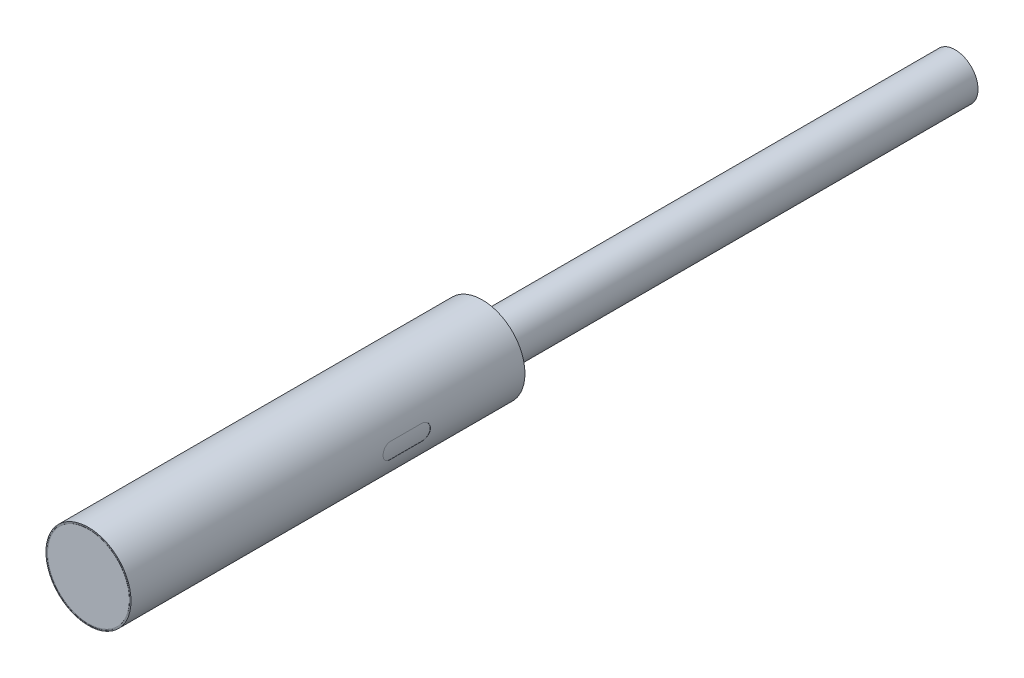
ISO-10303-21;
HEADER;
FILE_DESCRIPTION(('STEP AP214'),'2;1');
FILE_NAME('part.step','',(''),(''),'','','');
FILE_SCHEMA(('AUTOMOTIVE_DESIGN { 1 0 10303 214 1 1 1 1 }'));
ENDSEC;
DATA;
#1=APPLICATION_CONTEXT('core data for automotive mechanical design processes');
#2=APPLICATION_PROTOCOL_DEFINITION('international standard','automotive_design',2000,#1);
#3=PRODUCT_CONTEXT('',#1,'mechanical');
#4=PRODUCT('Part','Part','',(#3));
#5=PRODUCT_RELATED_PRODUCT_CATEGORY('part','',(#4));
#6=PRODUCT_DEFINITION_FORMATION('','',#4);
#7=PRODUCT_DEFINITION_CONTEXT('part definition',#1,'design');
#8=PRODUCT_DEFINITION('design','',#6,#7);
#9=PRODUCT_DEFINITION_SHAPE('','',#8);
#10=(LENGTH_UNIT() NAMED_UNIT(*) SI_UNIT(.MILLI.,.METRE.));
#11=(NAMED_UNIT(*) PLANE_ANGLE_UNIT() SI_UNIT($,.RADIAN.));
#12=(NAMED_UNIT(*) SI_UNIT($,.STERADIAN.) SOLID_ANGLE_UNIT());
#13=UNCERTAINTY_MEASURE_WITH_UNIT(LENGTH_MEASURE(1.E-05),#10,'distance_accuracy_value','');
#14=(GEOMETRIC_REPRESENTATION_CONTEXT(3) GLOBAL_UNCERTAINTY_ASSIGNED_CONTEXT((#13)) GLOBAL_UNIT_ASSIGNED_CONTEXT((#10,
#11,#12)) REPRESENTATION_CONTEXT('',''));
#15=CARTESIAN_POINT('',(0.,0.,0.));
#16=DIRECTION('',(0.,0.,1.));
#17=DIRECTION('',(1.,0.,0.));
#18=AXIS2_PLACEMENT_3D('',#15,#16,#17);
#19=CARTESIAN_POINT('',(0.,0.,-25.));
#20=DIRECTION('',(0.,0.,1.));
#21=DIRECTION('',(1.,0.,0.));
#22=AXIS2_PLACEMENT_3D('',#19,#20,#21);
#23=CYLINDRICAL_SURFACE('',#22,2.7);
#24=CARTESIAN_POINT('',(2.65383585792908,-0.497147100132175,-18.5));
#25=CARTESIAN_POINT('',(2.65397743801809,-0.496391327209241,-18.6331741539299));
#26=CARTESIAN_POINT('',(2.66464879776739,-0.445453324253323,-18.7598229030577));
#27=CARTESIAN_POINT('',(2.68300295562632,-0.306089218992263,-18.9004185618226));
#28=CARTESIAN_POINT('',(2.68888663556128,-0.252267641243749,-18.9365662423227));
#29=CARTESIAN_POINT('',(2.69755916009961,-0.130095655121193,-18.9873132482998));
#30=CARTESIAN_POINT('',(2.7,-0.0662868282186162,-18.9999999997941));
#31=CARTESIAN_POINT('',(2.7,0.0662868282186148,-18.9999999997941));
#32=CARTESIAN_POINT('',(2.69755838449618,0.130106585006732,-18.9872943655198));
#33=CARTESIAN_POINT('',(2.688887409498,0.252256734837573,-18.9365851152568));
#34=CARTESIAN_POINT('',(2.6830041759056,0.306079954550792,-18.9004091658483));
#35=CARTESIAN_POINT('',(2.67076562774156,0.399007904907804,-18.8066975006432));
#36=CARTESIAN_POINT('',(2.66488917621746,0.434748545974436,-18.7524292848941));
#37=CARTESIAN_POINT('',(2.65627069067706,0.484630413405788,-18.6302540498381));
#38=CARTESIAN_POINT('',(2.65384745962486,0.497085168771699,-18.5664734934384));
#39=CARTESIAN_POINT('',(2.65383585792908,0.497147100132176,-18.5));
#40=B_SPLINE_CURVE_WITH_KNOTS('',3,(#24,#25,#26,#27,#28,#29,#30,#31,#32,#33,#34,#35,#36,#37,#38,
#39),.UNSPECIFIED.,.F.,.F.,(4,2,2,2,2,2,2,4),(0.,0.25,0.375,0.5,0.625,0.75,0.875,1.),.UNSPECIFIED.);
#41=CARTESIAN_POINT('',(2.65383585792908,-0.497147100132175,-18.5));
#42=VERTEX_POINT('',#41);
#43=CARTESIAN_POINT('',(2.65383585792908,0.497147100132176,-18.5));
#44=VERTEX_POINT('',#43);
#45=EDGE_CURVE('E122',#42,#44,#40,.T.);
#46=ORIENTED_EDGE('',*,*,#45,.F.);
#47=DIRECTION('',(0.,0.,-1.));
#48=VECTOR('',#47,1.);
#49=CARTESIAN_POINT('',(2.65383585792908,-0.497147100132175,-16.5));
#50=LINE('',#49,#48);
#51=CARTESIAN_POINT('',(2.65383585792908,-0.497147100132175,-16.5));
#52=VERTEX_POINT('',#51);
#53=EDGE_CURVE('E128',#52,#42,#50,.T.);
#54=ORIENTED_EDGE('',*,*,#53,.F.);
#55=CARTESIAN_POINT('',(2.65383585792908,0.497147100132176,-16.5));
#56=CARTESIAN_POINT('',(2.65397743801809,0.496391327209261,-16.3668258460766));
#57=CARTESIAN_POINT('',(2.66464879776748,0.445453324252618,-16.2401770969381));
#58=CARTESIAN_POINT('',(2.68300295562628,0.306089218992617,-16.0995814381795));
#59=CARTESIAN_POINT('',(2.68888663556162,0.252267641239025,-16.0634337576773));
#60=CARTESIAN_POINT('',(2.69755916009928,0.130095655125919,-16.0126867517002));
#61=CARTESIAN_POINT('',(2.7,0.0662868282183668,-16.0000000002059));
#62=CARTESIAN_POINT('',(2.7,-0.0662868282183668,-16.0000000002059));
#63=CARTESIAN_POINT('',(2.69755838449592,-0.130106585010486,-16.0127056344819));
#64=CARTESIAN_POINT('',(2.68888740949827,-0.25225673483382,-16.0634148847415));
#65=CARTESIAN_POINT('',(2.68300417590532,-0.306079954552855,-16.0995908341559));
#66=CARTESIAN_POINT('',(2.67076562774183,-0.399007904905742,-16.1933024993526));
#67=CARTESIAN_POINT('',(2.66488917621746,-0.434748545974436,-16.2475707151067));
#68=CARTESIAN_POINT('',(2.65627069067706,-0.484630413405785,-16.369745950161));
#69=CARTESIAN_POINT('',(2.65384745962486,-0.497085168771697,-16.4335265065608));
#70=CARTESIAN_POINT('',(2.65383585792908,-0.497147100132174,-16.5));
#71=B_SPLINE_CURVE_WITH_KNOTS('',3,(#55,#56,#57,#58,#59,#60,#61,#62,#63,#64,#65,#66,#67,#68,#69,
#70),.UNSPECIFIED.,.F.,.F.,(4,2,2,2,2,2,2,4),(0.,0.25,0.375,0.5,0.625,0.75,0.875,1.),.UNSPECIFIED.);
#72=CARTESIAN_POINT('',(2.65383585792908,0.497147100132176,-16.5));
#73=VERTEX_POINT('',#72);
#74=EDGE_CURVE('E76',#73,#52,#71,.T.);
#75=ORIENTED_EDGE('',*,*,#74,.F.);
#76=DIRECTION('',(0.,0.,1.));
#77=VECTOR('',#76,1.);
#78=CARTESIAN_POINT('',(2.65383585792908,0.497147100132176,-18.5));
#79=LINE('',#78,#77);
#80=EDGE_CURVE('E113',#44,#73,#79,.T.);
#81=ORIENTED_EDGE('',*,*,#80,.F.);
#82=EDGE_LOOP('',(#46,#54,#75,#81));
#83=FACE_BOUND('',#82,.T.);
#84=CARTESIAN_POINT('',(0.,0.,-25.));
#85=DIRECTION('',(0.,0.,1.));
#86=DIRECTION('',(1.,0.,0.));
#87=AXIS2_PLACEMENT_3D('',#84,#85,#86);
#88=CIRCLE('',#87,2.7);
#89=CARTESIAN_POINT('',(2.7,0.,-25.));
#90=VERTEX_POINT('',#89);
#91=EDGE_CURVE('E68',#90,#90,#88,.T.);
#92=ORIENTED_EDGE('',*,*,#91,.T.);
#93=EDGE_LOOP('',(#92));
#94=FACE_BOUND('',#93,.T.);
#95=CARTESIAN_POINT('',(0.,0.,0.));
#96=DIRECTION('',(0.,0.,1.));
#97=DIRECTION('',(1.,0.,0.));
#98=AXIS2_PLACEMENT_3D('',#95,#96,#97);
#99=CIRCLE('',#98,2.7);
#100=CARTESIAN_POINT('',(2.7,0.,0.));
#101=VERTEX_POINT('',#100);
#102=EDGE_CURVE('E337',#101,#101,#99,.T.);
#103=ORIENTED_EDGE('',*,*,#102,.F.);
#104=EDGE_LOOP('',(#103));
#105=FACE_BOUND('',#104,.T.);
#106=ADVANCED_FACE('F58',(#83,#94,#105),#23,.T.);
#107=CARTESIAN_POINT('',(0.,0.,-25.));
#108=DIRECTION('',(0.,0.,1.));
#109=DIRECTION('',(1.,0.,0.));
#110=AXIS2_PLACEMENT_3D('',#107,#108,#109);
#111=PLANE('',#110);
#112=CARTESIAN_POINT('',(0.,0.,-25.));
#113=DIRECTION('',(0.,0.,1.));
#114=DIRECTION('',(1.,0.,0.));
#115=AXIS2_PLACEMENT_3D('',#112,#113,#114);
#116=CIRCLE('',#115,1.45);
#117=CARTESIAN_POINT('',(1.45,0.,-25.));
#118=VERTEX_POINT('',#117);
#119=EDGE_CURVE('E13',#118,#118,#116,.F.);
#120=ORIENTED_EDGE('',*,*,#119,.F.);
#121=EDGE_LOOP('',(#120));
#122=FACE_BOUND('',#121,.T.);
#123=ORIENTED_EDGE('',*,*,#91,.F.);
#124=EDGE_LOOP('',(#123));
#125=FACE_BOUND('',#124,.T.);
#126=ADVANCED_FACE('F286',(#122,#125),#111,.F.);
#127=CARTESIAN_POINT('',(0.,0.,0.));
#128=DIRECTION('',(0.,0.,1.));
#129=DIRECTION('',(1.,0.,0.));
#130=AXIS2_PLACEMENT_3D('',#127,#128,#129);
#131=PLANE('',#130);
#132=CARTESIAN_POINT('',(0.,0.,0.));
#133=DIRECTION('',(0.,0.,1.));
#134=DIRECTION('',(1.,0.,0.));
#135=AXIS2_PLACEMENT_3D('',#132,#133,#134);
#136=CIRCLE('',#135,2.65);
#137=CARTESIAN_POINT('',(2.65,0.,0.));
#138=VERTEX_POINT('',#137);
#139=EDGE_CURVE('E332',#138,#138,#136,.T.);
#140=ORIENTED_EDGE('',*,*,#139,.F.);
#141=EDGE_LOOP('',(#140));
#142=FACE_BOUND('',#141,.T.);
#143=ORIENTED_EDGE('',*,*,#102,.T.);
#144=EDGE_LOOP('',(#143));
#145=FACE_BOUND('',#144,.T.);
#146=ADVANCED_FACE('F290',(#142,#145),#131,.T.);
#147=CARTESIAN_POINT('',(0.,0.,-0.01));
#148=DIRECTION('',(0.,0.,1.));
#149=DIRECTION('',(1.,0.,0.));
#150=AXIS2_PLACEMENT_3D('',#147,#148,#149);
#151=CYLINDRICAL_SURFACE('',#150,2.65);
#152=CARTESIAN_POINT('',(0.,0.,-0.01));
#153=DIRECTION('',(0.,0.,1.));
#154=DIRECTION('',(1.,0.,0.));
#155=AXIS2_PLACEMENT_3D('',#152,#153,#154);
#156=CIRCLE('',#155,2.65);
#157=CARTESIAN_POINT('',(2.65,0.,-0.01));
#158=VERTEX_POINT('',#157);
#159=EDGE_CURVE('E334',#158,#158,#156,.T.);
#160=CARTESIAN_POINT('',(2.65,0.,-0.01));
#161=CARTESIAN_POINT('',(2.65,0.,-0.00989583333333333));
#162=CARTESIAN_POINT('',(2.65,0.,-0.00979166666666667));
#163=CARTESIAN_POINT('',(2.65,0.,-0.00958333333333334));
#164=CARTESIAN_POINT('',(2.65,0.,-0.00947916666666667));
#165=CARTESIAN_POINT('',(2.65,0.,-0.00927083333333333));
#166=CARTESIAN_POINT('',(2.65,0.,-0.00916666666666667));
#167=CARTESIAN_POINT('',(2.65,0.,-0.00895833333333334));
#168=CARTESIAN_POINT('',(2.65,0.,-0.00885416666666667));
#169=CARTESIAN_POINT('',(2.65,0.,-0.00864583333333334));
#170=CARTESIAN_POINT('',(2.65,0.,-0.00854166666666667));
#171=CARTESIAN_POINT('',(2.65,0.,-0.00833333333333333));
#172=CARTESIAN_POINT('',(2.65,0.,-0.00822916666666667));
#173=CARTESIAN_POINT('',(2.65,0.,-0.00802083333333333));
#174=CARTESIAN_POINT('',(2.65,0.,-0.00791666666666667));
#175=CARTESIAN_POINT('',(2.65,0.,-0.00770833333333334));
#176=CARTESIAN_POINT('',(2.65,0.,-0.00760416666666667));
#177=CARTESIAN_POINT('',(2.65,0.,-0.00739583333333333));
#178=CARTESIAN_POINT('',(2.65,0.,-0.00729166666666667));
#179=CARTESIAN_POINT('',(2.65,0.,-0.00708333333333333));
#180=CARTESIAN_POINT('',(2.65,0.,-0.00697916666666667));
#181=CARTESIAN_POINT('',(2.65,0.,-0.00677083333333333));
#182=CARTESIAN_POINT('',(2.65,0.,-0.00666666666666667));
#183=CARTESIAN_POINT('',(2.65,0.,-0.00645833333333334));
#184=CARTESIAN_POINT('',(2.65,0.,-0.00635416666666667));
#185=CARTESIAN_POINT('',(2.65,0.,-0.00614583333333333));
#186=CARTESIAN_POINT('',(2.65,0.,-0.00604166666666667));
#187=CARTESIAN_POINT('',(2.65,0.,-0.00583333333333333));
#188=CARTESIAN_POINT('',(2.65,0.,-0.00572916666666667));
#189=CARTESIAN_POINT('',(2.65,0.,-0.00552083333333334));
#190=CARTESIAN_POINT('',(2.65,0.,-0.00541666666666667));
#191=CARTESIAN_POINT('',(2.65,0.,-0.00520833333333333));
#192=CARTESIAN_POINT('',(2.65,0.,-0.00510416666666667));
#193=CARTESIAN_POINT('',(2.65,0.,-0.00489583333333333));
#194=CARTESIAN_POINT('',(2.65,0.,-0.00479166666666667));
#195=CARTESIAN_POINT('',(2.65,0.,-0.00458333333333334));
#196=CARTESIAN_POINT('',(2.65,0.,-0.00447916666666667));
#197=CARTESIAN_POINT('',(2.65,0.,-0.00427083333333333));
#198=CARTESIAN_POINT('',(2.65,0.,-0.00416666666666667));
#199=CARTESIAN_POINT('',(2.65,0.,-0.00395833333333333));
#200=CARTESIAN_POINT('',(2.65,0.,-0.00385416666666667));
#201=CARTESIAN_POINT('',(2.65,0.,-0.00364583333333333));
#202=CARTESIAN_POINT('',(2.65,0.,-0.00354166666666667));
#203=CARTESIAN_POINT('',(2.65,0.,-0.00333333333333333));
#204=CARTESIAN_POINT('',(2.65,0.,-0.00322916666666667));
#205=CARTESIAN_POINT('',(2.65,0.,-0.00302083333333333));
#206=CARTESIAN_POINT('',(2.65,0.,-0.00291666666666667));
#207=CARTESIAN_POINT('',(2.65,0.,-0.00270833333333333));
#208=CARTESIAN_POINT('',(2.65,0.,-0.00260416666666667));
#209=CARTESIAN_POINT('',(2.65,0.,-0.00239583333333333));
#210=CARTESIAN_POINT('',(2.65,0.,-0.00229166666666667));
#211=CARTESIAN_POINT('',(2.65,0.,-0.00208333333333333));
#212=CARTESIAN_POINT('',(2.65,0.,-0.00197916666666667));
#213=CARTESIAN_POINT('',(2.65,0.,-0.00177083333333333));
#214=CARTESIAN_POINT('',(2.65,0.,-0.00166666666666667));
#215=CARTESIAN_POINT('',(2.65,0.,-0.00145833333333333));
#216=CARTESIAN_POINT('',(2.65,0.,-0.00135416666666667));
#217=CARTESIAN_POINT('',(2.65,0.,-0.00114583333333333));
#218=CARTESIAN_POINT('',(2.65,0.,-0.00104166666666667));
#219=CARTESIAN_POINT('',(2.65,0.,-0.000833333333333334));
#220=CARTESIAN_POINT('',(2.65,0.,-0.000729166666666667));
#221=CARTESIAN_POINT('',(2.65,0.,-0.000520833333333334));
#222=CARTESIAN_POINT('',(2.65,0.,-0.000416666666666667));
#223=CARTESIAN_POINT('',(2.65,0.,-0.000208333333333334));
#224=CARTESIAN_POINT('',(2.65,0.,-0.000104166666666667));
#225=CARTESIAN_POINT('',(2.65,0.,0.));
#226=B_SPLINE_CURVE_WITH_KNOTS('',3,(#160,#161,#162,#163,#164,#165,#166,#167,#168,#169,#170,
#171,#172,#173,#174,#175,#176,#177,#178,#179,#180,#181,#182,#183,#184,#185,#186,#187,#188,#189,
#190,#191,#192,#193,#194,#195,#196,#197,#198,#199,#200,#201,#202,#203,#204,#205,#206,#207,#208,
#209,#210,#211,#212,#213,#214,#215,#216,#217,#218,#219,#220,#221,#222,#223,#224,#225),
.UNSPECIFIED.,.F.,.F.,(4,2,2,2,2,2,2,2,2,2,2,2,2,2,2,2,2,2,2,2,2,2,2,2,2,2,2,2,2,2,2,2,4),(0.,
0.000312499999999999,0.000625,0.000937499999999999,0.00125,0.0015625,0.001875,0.0021875,0.0025,
0.0028125,0.003125,0.0034375,0.00375,0.0040625,0.004375,0.0046875,0.005,0.0053125,0.005625,
0.0059375,0.00625,0.0065625,0.006875,0.0071875,0.0075,0.0078125,0.008125,0.0084375,0.00875,
0.0090625,0.009375,0.0096875,0.01),.UNSPECIFIED.);
#227=EDGE_CURVE('BSEAM296',#158,#138,#226,.T.);
#228=ORIENTED_EDGE('',*,*,#159,.F.);
#229=ORIENTED_EDGE('',*,*,#139,.T.);
#230=ORIENTED_EDGE('',*,*,#227,.T.);
#231=ORIENTED_EDGE('',*,*,#227,.F.);
#232=EDGE_LOOP('',(#228,#230,#229,#231));
#233=FACE_BOUND('',#232,.T.);
#234=ADVANCED_FACE('F296',(#233),#151,.F.);
#235=CARTESIAN_POINT('',(0.,0.,-0.01));
#236=DIRECTION('',(0.,0.,1.));
#237=DIRECTION('',(1.,0.,0.));
#238=AXIS2_PLACEMENT_3D('',#235,#236,#237);
#239=PLANE('',#238);
#240=CARTESIAN_POINT('',(0.,0.,-0.01));
#241=DIRECTION('',(0.,0.,1.));
#242=DIRECTION('',(1.,0.,0.));
#243=AXIS2_PLACEMENT_3D('',#240,#241,#242);
#244=CIRCLE('',#243,2.6);
#245=CARTESIAN_POINT('',(2.6,0.,-0.01));
#246=VERTEX_POINT('',#245);
#247=EDGE_CURVE('E325',#246,#246,#244,.T.);
#248=ORIENTED_EDGE('',*,*,#247,.F.);
#249=EDGE_LOOP('',(#248));
#250=FACE_BOUND('',#249,.T.);
#251=ORIENTED_EDGE('',*,*,#159,.T.);
#252=EDGE_LOOP('',(#251));
#253=FACE_BOUND('',#252,.T.);
#254=ADVANCED_FACE('F304',(#250,#253),#239,.T.);
#255=CARTESIAN_POINT('',(0.,0.,-0.01));
#256=DIRECTION('',(0.,0.,1.));
#257=DIRECTION('',(1.,0.,0.));
#258=AXIS2_PLACEMENT_3D('',#255,#256,#257);
#259=CYLINDRICAL_SURFACE('',#258,2.6);
#260=CARTESIAN_POINT('',(0.,0.,0.));
#261=DIRECTION('',(0.,0.,1.));
#262=DIRECTION('',(1.,0.,0.));
#263=AXIS2_PLACEMENT_3D('',#260,#261,#262);
#264=CIRCLE('',#263,2.6);
#265=CARTESIAN_POINT('',(2.6,0.,0.));
#266=VERTEX_POINT('',#265);
#267=EDGE_CURVE('E322',#266,#266,#264,.T.);
#268=CARTESIAN_POINT('',(2.6,0.,-0.01));
#269=CARTESIAN_POINT('',(2.6,0.,-0.00989583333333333));
#270=CARTESIAN_POINT('',(2.6,0.,-0.00979166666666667));
#271=CARTESIAN_POINT('',(2.6,0.,-0.00958333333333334));
#272=CARTESIAN_POINT('',(2.6,0.,-0.00947916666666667));
#273=CARTESIAN_POINT('',(2.6,0.,-0.00927083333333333));
#274=CARTESIAN_POINT('',(2.6,0.,-0.00916666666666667));
#275=CARTESIAN_POINT('',(2.6,0.,-0.00895833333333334));
#276=CARTESIAN_POINT('',(2.6,0.,-0.00885416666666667));
#277=CARTESIAN_POINT('',(2.6,0.,-0.00864583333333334));
#278=CARTESIAN_POINT('',(2.6,0.,-0.00854166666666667));
#279=CARTESIAN_POINT('',(2.6,0.,-0.00833333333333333));
#280=CARTESIAN_POINT('',(2.6,0.,-0.00822916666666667));
#281=CARTESIAN_POINT('',(2.6,0.,-0.00802083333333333));
#282=CARTESIAN_POINT('',(2.6,0.,-0.00791666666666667));
#283=CARTESIAN_POINT('',(2.6,0.,-0.00770833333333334));
#284=CARTESIAN_POINT('',(2.6,0.,-0.00760416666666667));
#285=CARTESIAN_POINT('',(2.6,0.,-0.00739583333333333));
#286=CARTESIAN_POINT('',(2.6,0.,-0.00729166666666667));
#287=CARTESIAN_POINT('',(2.6,0.,-0.00708333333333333));
#288=CARTESIAN_POINT('',(2.6,0.,-0.00697916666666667));
#289=CARTESIAN_POINT('',(2.6,0.,-0.00677083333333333));
#290=CARTESIAN_POINT('',(2.6,0.,-0.00666666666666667));
#291=CARTESIAN_POINT('',(2.6,0.,-0.00645833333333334));
#292=CARTESIAN_POINT('',(2.6,0.,-0.00635416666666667));
#293=CARTESIAN_POINT('',(2.6,0.,-0.00614583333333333));
#294=CARTESIAN_POINT('',(2.6,0.,-0.00604166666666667));
#295=CARTESIAN_POINT('',(2.6,0.,-0.00583333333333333));
#296=CARTESIAN_POINT('',(2.6,0.,-0.00572916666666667));
#297=CARTESIAN_POINT('',(2.6,0.,-0.00552083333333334));
#298=CARTESIAN_POINT('',(2.6,0.,-0.00541666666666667));
#299=CARTESIAN_POINT('',(2.6,0.,-0.00520833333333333));
#300=CARTESIAN_POINT('',(2.6,0.,-0.00510416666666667));
#301=CARTESIAN_POINT('',(2.6,0.,-0.00489583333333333));
#302=CARTESIAN_POINT('',(2.6,0.,-0.00479166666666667));
#303=CARTESIAN_POINT('',(2.6,0.,-0.00458333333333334));
#304=CARTESIAN_POINT('',(2.6,0.,-0.00447916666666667));
#305=CARTESIAN_POINT('',(2.6,0.,-0.00427083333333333));
#306=CARTESIAN_POINT('',(2.6,0.,-0.00416666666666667));
#307=CARTESIAN_POINT('',(2.6,0.,-0.00395833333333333));
#308=CARTESIAN_POINT('',(2.6,0.,-0.00385416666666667));
#309=CARTESIAN_POINT('',(2.6,0.,-0.00364583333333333));
#310=CARTESIAN_POINT('',(2.6,0.,-0.00354166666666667));
#311=CARTESIAN_POINT('',(2.6,0.,-0.00333333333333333));
#312=CARTESIAN_POINT('',(2.6,0.,-0.00322916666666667));
#313=CARTESIAN_POINT('',(2.6,0.,-0.00302083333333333));
#314=CARTESIAN_POINT('',(2.6,0.,-0.00291666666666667));
#315=CARTESIAN_POINT('',(2.6,0.,-0.00270833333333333));
#316=CARTESIAN_POINT('',(2.6,0.,-0.00260416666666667));
#317=CARTESIAN_POINT('',(2.6,0.,-0.00239583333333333));
#318=CARTESIAN_POINT('',(2.6,0.,-0.00229166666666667));
#319=CARTESIAN_POINT('',(2.6,0.,-0.00208333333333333));
#320=CARTESIAN_POINT('',(2.6,0.,-0.00197916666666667));
#321=CARTESIAN_POINT('',(2.6,0.,-0.00177083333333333));
#322=CARTESIAN_POINT('',(2.6,0.,-0.00166666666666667));
#323=CARTESIAN_POINT('',(2.6,0.,-0.00145833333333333));
#324=CARTESIAN_POINT('',(2.6,0.,-0.00135416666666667));
#325=CARTESIAN_POINT('',(2.6,0.,-0.00114583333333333));
#326=CARTESIAN_POINT('',(2.6,0.,-0.00104166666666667));
#327=CARTESIAN_POINT('',(2.6,0.,-0.000833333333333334));
#328=CARTESIAN_POINT('',(2.6,0.,-0.000729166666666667));
#329=CARTESIAN_POINT('',(2.6,0.,-0.000520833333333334));
#330=CARTESIAN_POINT('',(2.6,0.,-0.000416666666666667));
#331=CARTESIAN_POINT('',(2.6,0.,-0.000208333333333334));
#332=CARTESIAN_POINT('',(2.6,0.,-0.000104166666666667));
#333=CARTESIAN_POINT('',(2.6,0.,0.));
#334=B_SPLINE_CURVE_WITH_KNOTS('',3,(#268,#269,#270,#271,#272,#273,#274,#275,#276,#277,#278,
#279,#280,#281,#282,#283,#284,#285,#286,#287,#288,#289,#290,#291,#292,#293,#294,#295,#296,#297,
#298,#299,#300,#301,#302,#303,#304,#305,#306,#307,#308,#309,#310,#311,#312,#313,#314,#315,#316,
#317,#318,#319,#320,#321,#322,#323,#324,#325,#326,#327,#328,#329,#330,#331,#332,#333),
.UNSPECIFIED.,.F.,.F.,(4,2,2,2,2,2,2,2,2,2,2,2,2,2,2,2,2,2,2,2,2,2,2,2,2,2,2,2,2,2,2,2,4),(0.,
0.000312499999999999,0.000625,0.000937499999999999,0.00125,0.0015625,0.001875,0.0021875,0.0025,
0.0028125,0.003125,0.0034375,0.00375,0.0040625,0.004375,0.0046875,0.005,0.0053125,0.005625,
0.0059375,0.00625,0.0065625,0.006875,0.0071875,0.0075,0.0078125,0.008125,0.0084375,0.00875,
0.0090625,0.009375,0.0096875,0.01),.UNSPECIFIED.);
#335=EDGE_CURVE('BSEAM308',#246,#266,#334,.T.);
#336=ORIENTED_EDGE('',*,*,#247,.T.);
#337=ORIENTED_EDGE('',*,*,#267,.F.);
#338=ORIENTED_EDGE('',*,*,#335,.T.);
#339=ORIENTED_EDGE('',*,*,#335,.F.);
#340=EDGE_LOOP('',(#336,#338,#337,#339));
#341=FACE_BOUND('',#340,.T.);
#342=ADVANCED_FACE('F308',(#341),#259,.T.);
#343=ORIENTED_EDGE('',*,*,#267,.T.);
#344=EDGE_LOOP('',(#343));
#345=FACE_BOUND('',#344,.T.);
#346=ADVANCED_FACE('F298',(#345),#131,.T.);
#347=CARTESIAN_POINT('',(0.,0.,-55.));
#348=DIRECTION('',(0.,0.,1.));
#349=DIRECTION('',(1.,0.,0.));
#350=AXIS2_PLACEMENT_3D('',#347,#348,#349);
#351=CYLINDRICAL_SURFACE('',#350,1.45);
#352=CARTESIAN_POINT('',(0.,0.,-55.));
#353=DIRECTION('',(0.,0.,-1.));
#354=DIRECTION('',(-1.,0.,0.));
#355=AXIS2_PLACEMENT_3D('',#352,#353,#354);
#356=CIRCLE('',#355,1.45);
#357=CARTESIAN_POINT('',(-1.45,0.,-55.));
#358=VERTEX_POINT('',#357);
#359=EDGE_CURVE('E223',#358,#358,#356,.T.);
#360=ORIENTED_EDGE('',*,*,#359,.F.);
#361=EDGE_LOOP('',(#360));
#362=FACE_BOUND('',#361,.T.);
#363=ORIENTED_EDGE('',*,*,#119,.T.);
#364=EDGE_LOOP('',(#363));
#365=FACE_BOUND('',#364,.T.);
#366=ADVANCED_FACE('F313',(#362,#365),#351,.T.);
#367=CARTESIAN_POINT('',(0.,0.,-55.));
#368=DIRECTION('',(0.,0.,-1.));
#369=DIRECTION('',(-1.,0.,0.));
#370=AXIS2_PLACEMENT_3D('',#367,#368,#369);
#371=PLANE('',#370);
#372=ORIENTED_EDGE('',*,*,#359,.T.);
#373=EDGE_LOOP('',(#372));
#374=FACE_BOUND('',#373,.T.);
#375=ADVANCED_FACE('F244',(#374),#371,.T.);
#376=CARTESIAN_POINT('',(2.65383585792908,-0.497147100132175,-18.5));
#377=CARTESIAN_POINT('',(2.65397743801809,-0.496391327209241,-18.6331741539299));
#378=CARTESIAN_POINT('',(2.66464879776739,-0.445453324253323,-18.7598229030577));
#379=CARTESIAN_POINT('',(2.68300295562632,-0.306089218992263,-18.9004185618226));
#380=CARTESIAN_POINT('',(2.68888663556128,-0.252267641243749,-18.9365662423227));
#381=CARTESIAN_POINT('',(2.69755916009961,-0.130095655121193,-18.9873132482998));
#382=CARTESIAN_POINT('',(2.7,-0.0662868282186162,-18.9999999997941));
#383=CARTESIAN_POINT('',(2.7,0.0662868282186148,-18.9999999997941));
#384=CARTESIAN_POINT('',(2.69755838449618,0.130106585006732,-18.9872943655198));
#385=CARTESIAN_POINT('',(2.688887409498,0.252256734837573,-18.9365851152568));
#386=CARTESIAN_POINT('',(2.6830041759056,0.306079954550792,-18.9004091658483));
#387=CARTESIAN_POINT('',(2.67076562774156,0.399007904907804,-18.8066975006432));
#388=CARTESIAN_POINT('',(2.66488917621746,0.434748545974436,-18.7524292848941));
#389=CARTESIAN_POINT('',(2.65627069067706,0.484630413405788,-18.6302540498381));
#390=CARTESIAN_POINT('',(2.65384745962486,0.497085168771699,-18.5664734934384));
#391=CARTESIAN_POINT('',(2.65383585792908,0.497147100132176,-18.5));
#392=CARTESIAN_POINT('',(2.64400683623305,-0.49530581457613,-18.5));
#393=CARTESIAN_POINT('',(2.64414789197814,-0.494552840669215,-18.6331741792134));
#394=CARTESIAN_POINT('',(2.65477972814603,-0.443803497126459,-18.7598229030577));
#395=CARTESIAN_POINT('',(2.67306590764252,-0.304955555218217,-18.9004185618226));
#396=CARTESIAN_POINT('',(2.67892779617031,-0.25133331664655,-18.9365662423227));
#397=CARTESIAN_POINT('',(2.68756820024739,-0.129613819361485,-18.9873132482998));
#398=CARTESIAN_POINT('',(2.69,-0.0660413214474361,-18.9999999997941));
#399=CARTESIAN_POINT('',(2.69,0.0660413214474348,-18.9999999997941));
#400=CARTESIAN_POINT('',(2.68756742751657,0.129624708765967,-18.9872943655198));
#401=CARTESIAN_POINT('',(2.6789285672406,0.251322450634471,-18.9365851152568));
#402=CARTESIAN_POINT('',(2.67306712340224,0.304946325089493,-18.9004091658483));
#403=CARTESIAN_POINT('',(2.66087390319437,0.39753009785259,-18.8066975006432));
#404=CARTESIAN_POINT('',(2.65501921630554,0.433138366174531,-18.7524292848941));
#405=CARTESIAN_POINT('',(2.64643265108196,0.482835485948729,-18.6302540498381));
#406=CARTESIAN_POINT('',(2.64401839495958,0.495244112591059,-18.5664734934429));
#407=CARTESIAN_POINT('',(2.64400683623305,0.495305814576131,-18.5));
#408=B_SPLINE_SURFACE_WITH_KNOTS('',1,3,((#376,#377,#378,#379,#380,#381,#382,#383,#384,#385,
#386,#387,#388,#389,#390,#391),(#392,#393,#394,#395,#396,#397,#398,#399,#400,#401,#402,#403,
#404,#405,#406,#407)),.UNSPECIFIED.,.F.,.F.,.F.,(2,2),(4,2,2,2,2,2,2,4),(0.,1.),(0.,0.25,0.375,
0.5,0.625,0.75,0.875,1.),.UNSPECIFIED.);
#409=CARTESIAN_POINT('',(2.64400683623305,-0.49530581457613,-18.5));
#410=CARTESIAN_POINT('',(2.65383585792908,-0.497147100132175,-18.5));
#411=B_SPLINE_CURVE_WITH_KNOTS('',1,(#409,#410),.UNSPECIFIED.,.F.,.F.,(2,2),(0.,1.),.UNSPECIFIED.);
#412=CARTESIAN_POINT('',(2.64400683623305,-0.49530581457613,-18.5));
#413=VERTEX_POINT('',#412);
#414=EDGE_CURVE('E86',#413,#42,#411,.T.);
#415=CARTESIAN_POINT('',(2.65383585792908,0.497147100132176,-18.5));
#416=CARTESIAN_POINT('',(2.64400683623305,0.495305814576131,-18.5));
#417=B_SPLINE_CURVE_WITH_KNOTS('',1,(#415,#416),.UNSPECIFIED.,.F.,.F.,(2,2),(0.,1.),.UNSPECIFIED.);
#418=CARTESIAN_POINT('',(2.64400683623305,0.495305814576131,-18.5));
#419=VERTEX_POINT('',#418);
#420=EDGE_CURVE('E109',#419,#44,#417,.F.);
#421=CARTESIAN_POINT('',(2.64400683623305,0.495305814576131,-18.5));
#422=CARTESIAN_POINT('',(2.64401839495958,0.495244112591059,-18.5664734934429));
#423=CARTESIAN_POINT('',(2.64643265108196,0.482835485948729,-18.6302540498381));
#424=CARTESIAN_POINT('',(2.65501921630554,0.433138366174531,-18.7524292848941));
#425=CARTESIAN_POINT('',(2.66087390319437,0.39753009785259,-18.8066975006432));
#426=CARTESIAN_POINT('',(2.67306712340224,0.304946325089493,-18.9004091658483));
#427=CARTESIAN_POINT('',(2.6789285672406,0.251322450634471,-18.9365851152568));
#428=CARTESIAN_POINT('',(2.68756742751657,0.129624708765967,-18.9872943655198));
#429=CARTESIAN_POINT('',(2.69,0.0660413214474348,-18.9999999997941));
#430=CARTESIAN_POINT('',(2.69,-0.0660413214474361,-18.9999999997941));
#431=CARTESIAN_POINT('',(2.68756820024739,-0.129613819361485,-18.9873132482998));
#432=CARTESIAN_POINT('',(2.67892779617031,-0.25133331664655,-18.9365662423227));
#433=CARTESIAN_POINT('',(2.67306590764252,-0.304955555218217,-18.9004185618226));
#434=CARTESIAN_POINT('',(2.65477972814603,-0.443803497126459,-18.7598229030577));
#435=CARTESIAN_POINT('',(2.64414789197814,-0.494552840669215,-18.6331741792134));
#436=CARTESIAN_POINT('',(2.64400683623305,-0.49530581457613,-18.5));
#437=B_SPLINE_CURVE_WITH_KNOTS('',3,(#421,#422,#423,#424,#425,#426,#427,#428,#429,#430,#431,
#432,#433,#434,#435,#436),.UNSPECIFIED.,.F.,.F.,(4,2,2,2,2,2,2,4),(0.,0.125,0.25,0.375,0.5,
0.625,0.75,1.),.UNSPECIFIED.);
#438=EDGE_CURVE('E179',#413,#419,#437,.F.);
#439=ORIENTED_EDGE('',*,*,#414,.T.);
#440=ORIENTED_EDGE('',*,*,#45,.T.);
#441=ORIENTED_EDGE('',*,*,#420,.F.);
#442=ORIENTED_EDGE('',*,*,#438,.F.);
#443=EDGE_LOOP('',(#439,#440,#441,#442));
#444=FACE_BOUND('',#443,.T.);
#445=ADVANCED_FACE('F124',(#444),#408,.F.);
#446=CARTESIAN_POINT('',(2.65383585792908,0.497147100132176,-17.5));
#447=DIRECTION('',(-0.18412855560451,0.982902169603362,0.));
#448=DIRECTION('',(0.,0.,1.));
#449=AXIS2_PLACEMENT_3D('',#446,#447,#448);
#450=PLANE('',#449);
#451=ORIENTED_EDGE('',*,*,#420,.T.);
#452=ORIENTED_EDGE('',*,*,#80,.T.);
#453=CARTESIAN_POINT('',(2.64400683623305,0.495305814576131,-16.5));
#454=CARTESIAN_POINT('',(2.65383585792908,0.497147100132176,-16.5));
#455=B_SPLINE_CURVE_WITH_KNOTS('',1,(#453,#454),.UNSPECIFIED.,.F.,.F.,(2,2),(0.,1.),.UNSPECIFIED.);
#456=CARTESIAN_POINT('',(2.64400683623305,0.495305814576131,-16.5));
#457=VERTEX_POINT('',#456);
#458=EDGE_CURVE('E118',#457,#73,#455,.T.);
#459=ORIENTED_EDGE('',*,*,#458,.F.);
#460=DIRECTION('',(0.,0.,1.));
#461=VECTOR('',#460,1.);
#462=CARTESIAN_POINT('',(2.64400683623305,0.495305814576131,-25.));
#463=LINE('',#462,#461);
#464=EDGE_CURVE('E115',#419,#457,#463,.T.);
#465=ORIENTED_EDGE('',*,*,#464,.F.);
#466=EDGE_LOOP('',(#451,#452,#459,#465));
#467=FACE_BOUND('',#466,.T.);
#468=ADVANCED_FACE('F111',(#467),#450,.F.);
#469=CARTESIAN_POINT('',(2.65383585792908,0.497147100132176,-16.5));
#470=CARTESIAN_POINT('',(2.65397743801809,0.496391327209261,-16.3668258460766));
#471=CARTESIAN_POINT('',(2.66464879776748,0.445453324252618,-16.2401770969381));
#472=CARTESIAN_POINT('',(2.68300295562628,0.306089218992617,-16.0995814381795));
#473=CARTESIAN_POINT('',(2.68888663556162,0.252267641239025,-16.0634337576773));
#474=CARTESIAN_POINT('',(2.69755916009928,0.130095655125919,-16.0126867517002));
#475=CARTESIAN_POINT('',(2.7,0.0662868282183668,-16.0000000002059));
#476=CARTESIAN_POINT('',(2.7,-0.0662868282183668,-16.0000000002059));
#477=CARTESIAN_POINT('',(2.69755838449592,-0.130106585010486,-16.0127056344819));
#478=CARTESIAN_POINT('',(2.68888740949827,-0.25225673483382,-16.0634148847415));
#479=CARTESIAN_POINT('',(2.68300417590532,-0.306079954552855,-16.0995908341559));
#480=CARTESIAN_POINT('',(2.67076562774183,-0.399007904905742,-16.1933024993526));
#481=CARTESIAN_POINT('',(2.66488917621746,-0.434748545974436,-16.2475707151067));
#482=CARTESIAN_POINT('',(2.65627069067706,-0.484630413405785,-16.369745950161));
#483=CARTESIAN_POINT('',(2.65384745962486,-0.497085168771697,-16.4335265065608));
#484=CARTESIAN_POINT('',(2.65383585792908,-0.497147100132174,-16.5));
#485=CARTESIAN_POINT('',(2.64400683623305,0.495305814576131,-16.5));
#486=CARTESIAN_POINT('',(2.64414789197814,0.494552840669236,-16.3668258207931));
#487=CARTESIAN_POINT('',(2.65477972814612,0.443803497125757,-16.2401770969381));
#488=CARTESIAN_POINT('',(2.67306590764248,0.304955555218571,-16.0995814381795));
#489=CARTESIAN_POINT('',(2.67892779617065,0.251333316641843,-16.0634337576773));
#490=CARTESIAN_POINT('',(2.68756820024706,0.129613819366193,-16.0126867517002));
#491=CARTESIAN_POINT('',(2.69,0.0660413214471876,-16.0000000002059));
#492=CARTESIAN_POINT('',(2.69,-0.0660413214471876,-16.0000000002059));
#493=CARTESIAN_POINT('',(2.6875674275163,-0.129624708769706,-16.0127056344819));
#494=CARTESIAN_POINT('',(2.67892856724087,-0.251322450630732,-16.0634148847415));
#495=CARTESIAN_POINT('',(2.67306712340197,-0.304946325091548,-16.0995908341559));
#496=CARTESIAN_POINT('',(2.66087390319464,-0.397530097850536,-16.1933024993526));
#497=CARTESIAN_POINT('',(2.65501921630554,-0.43313836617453,-16.2475707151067));
#498=CARTESIAN_POINT('',(2.64643265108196,-0.482835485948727,-16.369745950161));
#499=CARTESIAN_POINT('',(2.64401839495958,-0.495244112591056,-16.4335265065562));
#500=CARTESIAN_POINT('',(2.64400683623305,-0.495305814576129,-16.5));
#501=B_SPLINE_SURFACE_WITH_KNOTS('',1,3,((#469,#470,#471,#472,#473,#474,#475,#476,#477,#478,
#479,#480,#481,#482,#483,#484),(#485,#486,#487,#488,#489,#490,#491,#492,#493,#494,#495,#496,
#497,#498,#499,#500)),.UNSPECIFIED.,.F.,.F.,.F.,(2,2),(4,2,2,2,2,2,2,4),(0.,1.),(0.,0.25,0.375,
0.5,0.625,0.75,0.875,1.),.UNSPECIFIED.);
#502=CARTESIAN_POINT('',(2.65383585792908,-0.497147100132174,-16.5));
#503=CARTESIAN_POINT('',(2.64400683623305,-0.495305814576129,-16.5));
#504=B_SPLINE_CURVE_WITH_KNOTS('',1,(#502,#503),.UNSPECIFIED.,.F.,.F.,(2,2),(0.,1.),.UNSPECIFIED.);
#505=CARTESIAN_POINT('',(2.64400683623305,-0.49530581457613,-16.5));
#506=VERTEX_POINT('',#505);
#507=EDGE_CURVE('E102',#506,#52,#504,.F.);
#508=CARTESIAN_POINT('',(2.64400683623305,-0.495305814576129,-16.5));
#509=CARTESIAN_POINT('',(2.64401839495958,-0.495244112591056,-16.4335265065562));
#510=CARTESIAN_POINT('',(2.64643265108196,-0.482835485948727,-16.369745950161));
#511=CARTESIAN_POINT('',(2.65501921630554,-0.43313836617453,-16.2475707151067));
#512=CARTESIAN_POINT('',(2.66087390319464,-0.397530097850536,-16.1933024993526));
#513=CARTESIAN_POINT('',(2.67306712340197,-0.304946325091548,-16.0995908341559));
#514=CARTESIAN_POINT('',(2.67892856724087,-0.251322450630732,-16.0634148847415));
#515=CARTESIAN_POINT('',(2.6875674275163,-0.129624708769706,-16.0127056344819));
#516=CARTESIAN_POINT('',(2.69,-0.0660413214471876,-16.0000000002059));
#517=CARTESIAN_POINT('',(2.69,0.0660413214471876,-16.0000000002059));
#518=CARTESIAN_POINT('',(2.68756820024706,0.129613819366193,-16.0126867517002));
#519=CARTESIAN_POINT('',(2.67892779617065,0.251333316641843,-16.0634337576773));
#520=CARTESIAN_POINT('',(2.67306590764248,0.304955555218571,-16.0995814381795));
#521=CARTESIAN_POINT('',(2.65477972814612,0.443803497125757,-16.2401770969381));
#522=CARTESIAN_POINT('',(2.64414789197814,0.494552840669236,-16.3668258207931));
#523=CARTESIAN_POINT('',(2.64400683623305,0.495305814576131,-16.5));
#524=B_SPLINE_CURVE_WITH_KNOTS('',3,(#508,#509,#510,#511,#512,#513,#514,#515,#516,#517,#518,
#519,#520,#521,#522,#523),.UNSPECIFIED.,.F.,.F.,(4,2,2,2,2,2,2,4),(0.,0.125,0.25,0.375,0.5,
0.625,0.75,1.),.UNSPECIFIED.);
#525=EDGE_CURVE('E148',#457,#506,#524,.F.);
#526=ORIENTED_EDGE('',*,*,#458,.T.);
#527=ORIENTED_EDGE('',*,*,#74,.T.);
#528=ORIENTED_EDGE('',*,*,#507,.F.);
#529=ORIENTED_EDGE('',*,*,#525,.F.);
#530=EDGE_LOOP('',(#526,#527,#528,#529));
#531=FACE_BOUND('',#530,.T.);
#532=ADVANCED_FACE('F164',(#531),#501,.F.);
#533=CARTESIAN_POINT('',(2.65383585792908,-0.497147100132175,-17.5));
#534=DIRECTION('',(-0.184128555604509,-0.982902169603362,0.));
#535=DIRECTION('',(0.,0.,-1.));
#536=AXIS2_PLACEMENT_3D('',#533,#534,#535);
#537=PLANE('',#536);
#538=DIRECTION('',(0.,0.,1.));
#539=VECTOR('',#538,1.);
#540=CARTESIAN_POINT('',(2.64400683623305,-0.49530581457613,-25.));
#541=LINE('',#540,#539);
#542=EDGE_CURVE('E199',#506,#413,#541,.F.);
#543=ORIENTED_EDGE('',*,*,#542,.F.);
#544=ORIENTED_EDGE('',*,*,#507,.T.);
#545=ORIENTED_EDGE('',*,*,#53,.T.);
#546=ORIENTED_EDGE('',*,*,#414,.F.);
#547=EDGE_LOOP('',(#543,#544,#545,#546));
#548=FACE_BOUND('',#547,.T.);
#549=ADVANCED_FACE('F163',(#548),#537,.F.);
#550=CARTESIAN_POINT('',(0.,0.,-25.));
#551=DIRECTION('',(0.,0.,1.));
#552=DIRECTION('',(1.,0.,0.));
#553=AXIS2_PLACEMENT_3D('',#550,#551,#552);
#554=CYLINDRICAL_SURFACE('',#553,2.69);
#555=ORIENTED_EDGE('',*,*,#525,.T.);
#556=ORIENTED_EDGE('',*,*,#542,.T.);
#557=ORIENTED_EDGE('',*,*,#438,.T.);
#558=ORIENTED_EDGE('',*,*,#464,.T.);
#559=EDGE_LOOP('',(#555,#556,#557,#558));
#560=FACE_BOUND('',#559,.T.);
#561=ADVANCED_FACE('F154',(#560),#554,.T.);
#562=CLOSED_SHELL('',(#106,#126,#146,#234,#254,#342,#346,#366,#375,#445,#468,#532,#549,#561));
#563=MANIFOLD_SOLID_BREP('B2',#562);
#564=ADVANCED_BREP_SHAPE_REPRESENTATION('',(#18,#563),#14);
#565=SHAPE_DEFINITION_REPRESENTATION(#9,#564);
ENDSEC;
END-ISO-10303-21;
